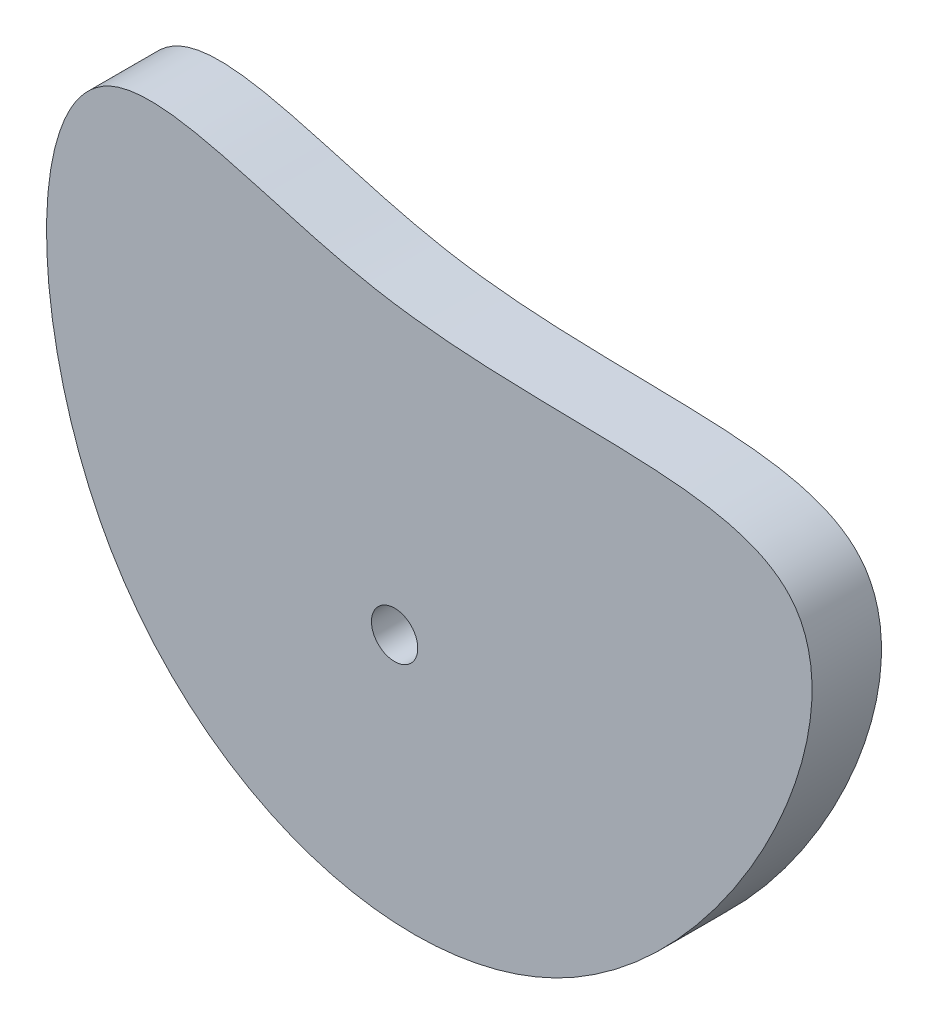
ISO-10303-21;
HEADER;
FILE_DESCRIPTION(('STEP AP214'),'2;1');
FILE_NAME('part.step','',(''),(''),'','','');
FILE_SCHEMA(('AUTOMOTIVE_DESIGN { 1 0 10303 214 1 1 1 1 }'));
ENDSEC;
DATA;
#1=APPLICATION_CONTEXT('core data for automotive mechanical design processes');
#2=APPLICATION_PROTOCOL_DEFINITION('international standard','automotive_design',2000,#1);
#3=PRODUCT_CONTEXT('',#1,'mechanical');
#4=PRODUCT('Part','Part','',(#3));
#5=PRODUCT_RELATED_PRODUCT_CATEGORY('part','',(#4));
#6=PRODUCT_DEFINITION_FORMATION('','',#4);
#7=PRODUCT_DEFINITION_CONTEXT('part definition',#1,'design');
#8=PRODUCT_DEFINITION('design','',#6,#7);
#9=PRODUCT_DEFINITION_SHAPE('','',#8);
#10=(LENGTH_UNIT() NAMED_UNIT(*) SI_UNIT(.MILLI.,.METRE.));
#11=(NAMED_UNIT(*) PLANE_ANGLE_UNIT() SI_UNIT($,.RADIAN.));
#12=(NAMED_UNIT(*) SI_UNIT($,.STERADIAN.) SOLID_ANGLE_UNIT());
#13=UNCERTAINTY_MEASURE_WITH_UNIT(LENGTH_MEASURE(1.E-05),#10,'distance_accuracy_value','');
#14=(GEOMETRIC_REPRESENTATION_CONTEXT(3) GLOBAL_UNCERTAINTY_ASSIGNED_CONTEXT((#13)) GLOBAL_UNIT_ASSIGNED_CONTEXT((#10,
#11,#12)) REPRESENTATION_CONTEXT('',''));
#15=CARTESIAN_POINT('',(0.,0.,0.));
#16=DIRECTION('',(0.,0.,1.));
#17=DIRECTION('',(1.,0.,0.));
#18=AXIS2_PLACEMENT_3D('',#15,#16,#17);
#19=CARTESIAN_POINT('',(0.,0.,19.05));
#20=DIRECTION('',(0.,0.,1.));
#21=DIRECTION('',(1.,0.,0.));
#22=AXIS2_PLACEMENT_3D('',#19,#20,#21);
#23=PLANE('',#22);
#24=CARTESIAN_POINT('',(0.,0.,19.05));
#25=DIRECTION('',(0.,0.,1.));
#26=DIRECTION('',(1.,0.,0.));
#27=AXIS2_PLACEMENT_3D('',#24,#25,#26);
#28=CIRCLE('',#27,6.35);
#29=CARTESIAN_POINT('',(-6.35,0.,19.05));
#30=VERTEX_POINT('',#29);
#31=EDGE_CURVE('E10',#30,#30,#28,.T.);
#32=ORIENTED_EDGE('',*,*,#31,.F.);
#33=EDGE_LOOP('',(#32));
#34=FACE_BOUND('',#33,.T.);
#35=CARTESIAN_POINT('',(-5.30556216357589,79.5436518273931,19.05));
#36=CARTESIAN_POINT('',(-35.4453784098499,85.0817970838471,19.05));
#37=CARTESIAN_POINT('',(-102.523033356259,118.988112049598,19.05));
#38=CARTESIAN_POINT('',(-98.5120014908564,-48.9826781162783,19.05));
#39=CARTESIAN_POINT('',(59.5568069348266,-101.223747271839,19.05));
#40=CARTESIAN_POINT('',(156.31151782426,96.6805015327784,19.05));
#41=CARTESIAN_POINT('',(41.947300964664,70.8610103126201,19.05));
#42=CARTESIAN_POINT('',(-5.30556216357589,79.5436518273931,19.05));
#43=B_SPLINE_CURVE_WITH_KNOTS('',3,(#35,#36,#37,#38,#39,#40,#41,#42),.UNSPECIFIED.,.T.,.F.,(4,1,
1,1,1,4),(0.,0.131653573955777,0.319441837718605,0.557825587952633,0.793595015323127,1.),.UNSPECIFIED.);
#44=CARTESIAN_POINT('',(-5.30556216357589,79.5436518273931,19.05));
#45=VERTEX_POINT('',#44);
#46=EDGE_CURVE('E39',#45,#45,#43,.T.);
#47=ORIENTED_EDGE('',*,*,#46,.T.);
#48=EDGE_LOOP('',(#47));
#49=FACE_BOUND('',#48,.T.);
#50=ADVANCED_FACE('F25',(#34,#49),#23,.T.);
#51=CARTESIAN_POINT('',(0.,0.,0.));
#52=DIRECTION('',(0.,0.,1.));
#53=DIRECTION('',(1.,0.,0.));
#54=AXIS2_PLACEMENT_3D('',#51,#52,#53);
#55=PLANE('',#54);
#56=CARTESIAN_POINT('',(0.,0.,0.));
#57=DIRECTION('',(0.,0.,1.));
#58=DIRECTION('',(1.,0.,0.));
#59=AXIS2_PLACEMENT_3D('',#56,#57,#58);
#60=CIRCLE('',#59,6.35);
#61=CARTESIAN_POINT('',(-6.35,0.,0.));
#62=VERTEX_POINT('',#61);
#63=EDGE_CURVE('E31',#62,#62,#60,.T.);
#64=ORIENTED_EDGE('',*,*,#63,.T.);
#65=EDGE_LOOP('',(#64));
#66=FACE_BOUND('',#65,.T.);
#67=CARTESIAN_POINT('',(-5.30556216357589,79.5436518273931,0.));
#68=CARTESIAN_POINT('',(-35.4453784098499,85.0817970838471,0.));
#69=CARTESIAN_POINT('',(-102.523033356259,118.988112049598,0.));
#70=CARTESIAN_POINT('',(-98.5120014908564,-48.9826781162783,0.));
#71=CARTESIAN_POINT('',(59.5568069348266,-101.223747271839,0.));
#72=CARTESIAN_POINT('',(156.31151782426,96.6805015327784,0.));
#73=CARTESIAN_POINT('',(41.947300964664,70.8610103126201,0.));
#74=CARTESIAN_POINT('',(-5.30556216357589,79.5436518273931,0.));
#75=B_SPLINE_CURVE_WITH_KNOTS('',3,(#67,#68,#69,#70,#71,#72,#73,#74),.UNSPECIFIED.,.T.,.F.,(4,1,
1,1,1,4),(0.,0.131653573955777,0.319441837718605,0.557825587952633,0.793595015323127,1.),.UNSPECIFIED.);
#76=CARTESIAN_POINT('',(-5.30556216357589,79.5436518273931,0.));
#77=VERTEX_POINT('',#76);
#78=EDGE_CURVE('E35',#77,#77,#75,.F.);
#79=ORIENTED_EDGE('',*,*,#78,.T.);
#80=EDGE_LOOP('',(#79));
#81=FACE_BOUND('',#80,.T.);
#82=ADVANCED_FACE('F58',(#66,#81),#55,.F.);
#83=CARTESIAN_POINT('',(0.,0.,19.05));
#84=DIRECTION('',(0.,0.,-1.));
#85=DIRECTION('',(-1.,0.,0.));
#86=AXIS2_PLACEMENT_3D('',#83,#84,#85);
#87=CYLINDRICAL_SURFACE('',#86,6.35);
#88=CARTESIAN_POINT('',(-6.35,0.,19.05));
#89=CARTESIAN_POINT('',(-6.35,0.,18.8515625));
#90=CARTESIAN_POINT('',(-6.35,0.,18.653125));
#91=CARTESIAN_POINT('',(-6.35,0.,18.25625));
#92=CARTESIAN_POINT('',(-6.35,0.,18.0578125));
#93=CARTESIAN_POINT('',(-6.35,0.,17.6609375));
#94=CARTESIAN_POINT('',(-6.35,0.,17.4625));
#95=CARTESIAN_POINT('',(-6.35,0.,17.065625));
#96=CARTESIAN_POINT('',(-6.35,0.,16.8671875));
#97=CARTESIAN_POINT('',(-6.35,0.,16.4703125));
#98=CARTESIAN_POINT('',(-6.35,0.,16.271875));
#99=CARTESIAN_POINT('',(-6.35,0.,15.875));
#100=CARTESIAN_POINT('',(-6.35,0.,15.6765625));
#101=CARTESIAN_POINT('',(-6.35,0.,15.2796875));
#102=CARTESIAN_POINT('',(-6.35,0.,15.08125));
#103=CARTESIAN_POINT('',(-6.35,0.,14.684375));
#104=CARTESIAN_POINT('',(-6.35,0.,14.4859375));
#105=CARTESIAN_POINT('',(-6.35,0.,14.0890625));
#106=CARTESIAN_POINT('',(-6.35,0.,13.890625));
#107=CARTESIAN_POINT('',(-6.35,0.,13.49375));
#108=CARTESIAN_POINT('',(-6.35,0.,13.2953125));
#109=CARTESIAN_POINT('',(-6.35,0.,12.8984375));
#110=CARTESIAN_POINT('',(-6.35,0.,12.7));
#111=CARTESIAN_POINT('',(-6.35,0.,12.303125));
#112=CARTESIAN_POINT('',(-6.35,0.,12.1046875));
#113=CARTESIAN_POINT('',(-6.35,0.,11.7078125));
#114=CARTESIAN_POINT('',(-6.35,0.,11.509375));
#115=CARTESIAN_POINT('',(-6.35,0.,11.1125));
#116=CARTESIAN_POINT('',(-6.35,0.,10.9140625));
#117=CARTESIAN_POINT('',(-6.35,0.,10.5171875));
#118=CARTESIAN_POINT('',(-6.35,0.,10.31875));
#119=CARTESIAN_POINT('',(-6.35,0.,9.921875));
#120=CARTESIAN_POINT('',(-6.35,0.,9.7234375));
#121=CARTESIAN_POINT('',(-6.35,0.,9.3265625));
#122=CARTESIAN_POINT('',(-6.35,0.,9.128125));
#123=CARTESIAN_POINT('',(-6.35,0.,8.73125));
#124=CARTESIAN_POINT('',(-6.35,0.,8.5328125));
#125=CARTESIAN_POINT('',(-6.35,0.,8.1359375));
#126=CARTESIAN_POINT('',(-6.35,0.,7.9375));
#127=CARTESIAN_POINT('',(-6.35,0.,7.540625));
#128=CARTESIAN_POINT('',(-6.35,0.,7.3421875));
#129=CARTESIAN_POINT('',(-6.35,0.,6.9453125));
#130=CARTESIAN_POINT('',(-6.35,0.,6.746875));
#131=CARTESIAN_POINT('',(-6.35,0.,6.35));
#132=CARTESIAN_POINT('',(-6.35,0.,6.1515625));
#133=CARTESIAN_POINT('',(-6.35,0.,5.7546875));
#134=CARTESIAN_POINT('',(-6.35,0.,5.55625));
#135=CARTESIAN_POINT('',(-6.35,0.,5.159375));
#136=CARTESIAN_POINT('',(-6.35,0.,4.9609375));
#137=CARTESIAN_POINT('',(-6.35,0.,4.5640625));
#138=CARTESIAN_POINT('',(-6.35,0.,4.365625));
#139=CARTESIAN_POINT('',(-6.35,0.,3.96875));
#140=CARTESIAN_POINT('',(-6.35,0.,3.7703125));
#141=CARTESIAN_POINT('',(-6.35,0.,3.3734375));
#142=CARTESIAN_POINT('',(-6.35,0.,3.175));
#143=CARTESIAN_POINT('',(-6.35,0.,2.778125));
#144=CARTESIAN_POINT('',(-6.35,0.,2.5796875));
#145=CARTESIAN_POINT('',(-6.35,0.,2.1828125));
#146=CARTESIAN_POINT('',(-6.35,0.,1.984375));
#147=CARTESIAN_POINT('',(-6.35,0.,1.5875));
#148=CARTESIAN_POINT('',(-6.35,0.,1.3890625));
#149=CARTESIAN_POINT('',(-6.35,0.,0.992187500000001));
#150=CARTESIAN_POINT('',(-6.35,0.,0.793750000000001));
#151=CARTESIAN_POINT('',(-6.35,0.,0.396875));
#152=CARTESIAN_POINT('',(-6.35,0.,0.1984375));
#153=CARTESIAN_POINT('',(-6.35,0.,0.));
#154=B_SPLINE_CURVE_WITH_KNOTS('',3,(#88,#89,#90,#91,#92,#93,#94,#95,#96,#97,#98,#99,#100,#101,
#102,#103,#104,#105,#106,#107,#108,#109,#110,#111,#112,#113,#114,#115,#116,#117,#118,#119,#120,
#121,#122,#123,#124,#125,#126,#127,#128,#129,#130,#131,#132,#133,#134,#135,#136,#137,#138,#139,
#140,#141,#142,#143,#144,#145,#146,#147,#148,#149,#150,#151,#152,#153),.UNSPECIFIED.,.F.,.F.,(4,
2,2,2,2,2,2,2,2,2,2,2,2,2,2,2,2,2,2,2,2,2,2,2,2,2,2,2,2,2,2,2,4),(0.,0.5953125,1.190625,
1.7859375,2.38125,2.9765625,3.571875,4.1671875,4.7625,5.3578125,5.953125,6.5484375,7.14375,
7.7390625,8.334375,8.9296875,9.525,10.1203125,10.715625,11.3109375,11.90625,12.5015625,
13.096875,13.6921875,14.2875,14.8828125,15.478125,16.0734375,16.66875,17.2640625,17.859375,
18.4546875,19.05),.UNSPECIFIED.);
#155=EDGE_CURVE('BSEAM55',#30,#62,#154,.T.);
#156=ORIENTED_EDGE('',*,*,#31,.T.);
#157=ORIENTED_EDGE('',*,*,#63,.F.);
#158=ORIENTED_EDGE('',*,*,#155,.T.);
#159=ORIENTED_EDGE('',*,*,#155,.F.);
#160=EDGE_LOOP('',(#156,#158,#157,#159));
#161=FACE_BOUND('',#160,.T.);
#162=ADVANCED_FACE('F55',(#161),#87,.F.);
#163=CARTESIAN_POINT('',(-5.30556216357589,79.5436518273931,-271.254127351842));
#164=CARTESIAN_POINT('',(-35.4453784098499,85.0817970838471,-271.254127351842));
#165=CARTESIAN_POINT('',(-102.523033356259,118.988112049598,-271.254127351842));
#166=CARTESIAN_POINT('',(-98.5120014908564,-48.9826781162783,-271.254127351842));
#167=CARTESIAN_POINT('',(59.5568069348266,-101.223747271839,-271.254127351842));
#168=CARTESIAN_POINT('',(156.31151782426,96.6805015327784,-271.254127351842));
#169=CARTESIAN_POINT('',(41.947300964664,70.8610103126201,-271.254127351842));
#170=CARTESIAN_POINT('',(-5.30556216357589,79.5436518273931,-271.254127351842));
#171=B_SPLINE_CURVE_WITH_KNOTS('',3,(#163,#164,#165,#166,#167,#168,#169,#170),.UNSPECIFIED.,.T.,
.F.,(4,1,1,1,1,4),(0.,0.131653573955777,0.319441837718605,0.557825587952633,0.793595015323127,
1.),.UNSPECIFIED.);
#172=DIRECTION('',(0.,0.,1.));
#173=VECTOR('',#172,1.);
#174=SURFACE_OF_LINEAR_EXTRUSION('',#171,#173);
#175=ORIENTED_EDGE('',*,*,#78,.F.);
#176=EDGE_LOOP('',(#175));
#177=FACE_BOUND('',#176,.T.);
#178=ORIENTED_EDGE('',*,*,#46,.F.);
#179=EDGE_LOOP('',(#178));
#180=FACE_BOUND('',#179,.T.);
#181=ADVANCED_FACE('F52',(#177,#180),#174,.T.);
#182=CLOSED_SHELL('',(#50,#82,#162,#181));
#183=MANIFOLD_SOLID_BREP('B2',#182);
#184=ADVANCED_BREP_SHAPE_REPRESENTATION('',(#18,#183),#14);
#185=SHAPE_DEFINITION_REPRESENTATION(#9,#184);
ENDSEC;
END-ISO-10303-21;
